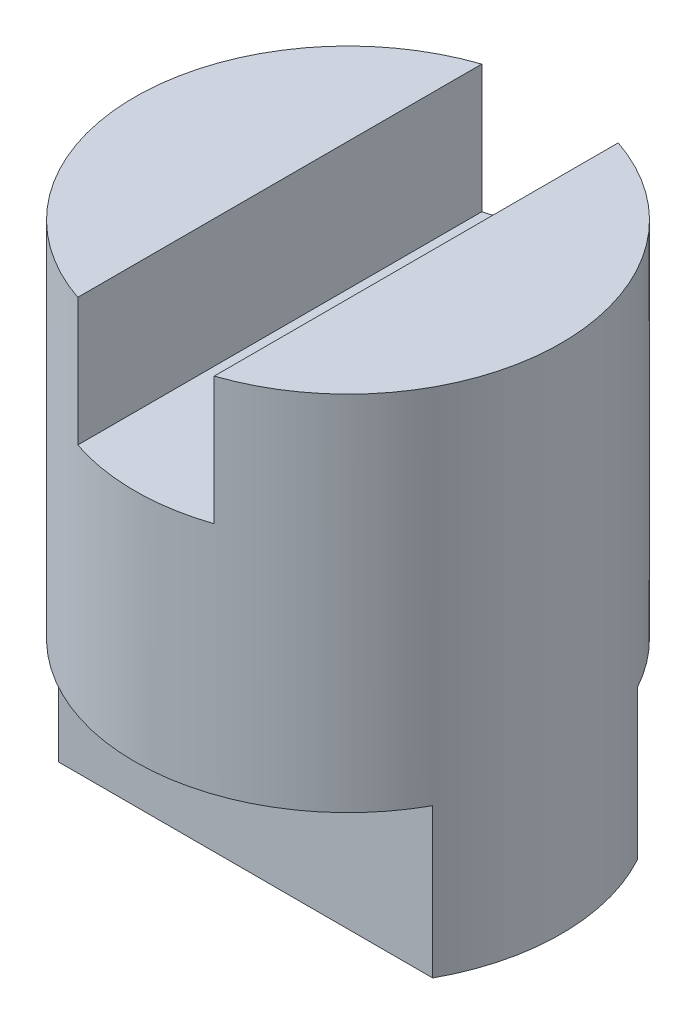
ISO-10303-21;
HEADER;
FILE_DESCRIPTION(('STEP AP214'),'2;1');
FILE_NAME('part.step','',(''),(''),'','','');
FILE_SCHEMA(('AUTOMOTIVE_DESIGN { 1 0 10303 214 1 1 1 1 }'));
ENDSEC;
DATA;
#1=APPLICATION_CONTEXT('core data for automotive mechanical design processes');
#2=APPLICATION_PROTOCOL_DEFINITION('international standard','automotive_design',2000,#1);
#3=PRODUCT_CONTEXT('',#1,'mechanical');
#4=PRODUCT('Part','Part','',(#3));
#5=PRODUCT_RELATED_PRODUCT_CATEGORY('part','',(#4));
#6=PRODUCT_DEFINITION_FORMATION('','',#4);
#7=PRODUCT_DEFINITION_CONTEXT('part definition',#1,'design');
#8=PRODUCT_DEFINITION('design','',#6,#7);
#9=PRODUCT_DEFINITION_SHAPE('','',#8);
#10=(LENGTH_UNIT() NAMED_UNIT(*) SI_UNIT(.MILLI.,.METRE.));
#11=(NAMED_UNIT(*) PLANE_ANGLE_UNIT() SI_UNIT($,.RADIAN.));
#12=(NAMED_UNIT(*) SI_UNIT($,.STERADIAN.) SOLID_ANGLE_UNIT());
#13=UNCERTAINTY_MEASURE_WITH_UNIT(LENGTH_MEASURE(1.E-05),#10,'distance_accuracy_value','');
#14=(GEOMETRIC_REPRESENTATION_CONTEXT(3) GLOBAL_UNCERTAINTY_ASSIGNED_CONTEXT((#13)) GLOBAL_UNIT_ASSIGNED_CONTEXT((#10,
#11,#12)) REPRESENTATION_CONTEXT('',''));
#15=CARTESIAN_POINT('',(0.,0.,0.));
#16=DIRECTION('',(0.,0.,1.));
#17=DIRECTION('',(1.,0.,0.));
#18=AXIS2_PLACEMENT_3D('',#15,#16,#17);
#19=CARTESIAN_POINT('',(0.,120.,0.));
#20=DIRECTION('',(0.,1.,0.));
#21=DIRECTION('',(0.,0.,1.));
#22=AXIS2_PLACEMENT_3D('',#19,#20,#21);
#23=PLANE('',#22);
#24=CARTESIAN_POINT('',(0.,120.,0.));
#25=DIRECTION('',(0.,1.,0.));
#26=DIRECTION('',(0.,0.,1.));
#27=AXIS2_PLACEMENT_3D('',#24,#25,#26);
#28=CIRCLE('',#27,50.);
#29=CARTESIAN_POINT('',(-16.,120.,-47.370877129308));
#30=VERTEX_POINT('',#29);
#31=CARTESIAN_POINT('',(-16.,120.,47.3708771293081));
#32=VERTEX_POINT('',#31);
#33=EDGE_CURVE('E117',#30,#32,#28,.T.);
#34=ORIENTED_EDGE('',*,*,#33,.T.);
#35=DIRECTION('',(0.,0.,-1.));
#36=VECTOR('',#35,1.);
#37=CARTESIAN_POINT('',(-16.,120.,0.));
#38=LINE('',#37,#36);
#39=EDGE_CURVE('E122',#32,#30,#38,.T.);
#40=ORIENTED_EDGE('',*,*,#39,.T.);
#41=EDGE_LOOP('',(#34,#40));
#42=FACE_BOUND('',#41,.T.);
#43=ADVANCED_FACE('F31',(#42),#23,.T.);
#44=CARTESIAN_POINT('',(0.,120.,0.));
#45=DIRECTION('',(0.,-1.,0.));
#46=DIRECTION('',(0.,0.,-1.));
#47=AXIS2_PLACEMENT_3D('',#44,#45,#46);
#48=CYLINDRICAL_SURFACE('',#47,50.);
#49=CARTESIAN_POINT('',(0.,90.,0.));
#50=DIRECTION('',(0.,-1.,0.));
#51=DIRECTION('',(0.,0.,-1.));
#52=AXIS2_PLACEMENT_3D('',#49,#50,#51);
#53=CIRCLE('',#52,50.);
#54=CARTESIAN_POINT('',(-16.,90.,-47.370877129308));
#55=VERTEX_POINT('',#54);
#56=CARTESIAN_POINT('',(16.,90.,-47.3708771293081));
#57=VERTEX_POINT('',#56);
#58=EDGE_CURVE('E118',#55,#57,#53,.T.);
#59=ORIENTED_EDGE('',*,*,#58,.T.);
#60=DIRECTION('',(0.,-1.,0.));
#61=VECTOR('',#60,1.);
#62=CARTESIAN_POINT('',(16.,120.,-47.370877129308));
#63=LINE('',#62,#61);
#64=CARTESIAN_POINT('',(16.,120.,-47.370877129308));
#65=VERTEX_POINT('',#64);
#66=EDGE_CURVE('E121',#57,#65,#63,.F.);
#67=ORIENTED_EDGE('',*,*,#66,.T.);
#68=CARTESIAN_POINT('',(16.,120.,47.3708771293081));
#69=VERTEX_POINT('',#68);
#70=EDGE_CURVE('E125',#69,#65,#28,.T.);
#71=ORIENTED_EDGE('',*,*,#70,.F.);
#72=DIRECTION('',(0.,-1.,0.));
#73=VECTOR('',#72,1.);
#74=CARTESIAN_POINT('',(16.,120.,47.370877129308));
#75=LINE('',#74,#73);
#76=CARTESIAN_POINT('',(16.,90.,47.3708771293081));
#77=VERTEX_POINT('',#76);
#78=EDGE_CURVE('E126',#69,#77,#75,.T.);
#79=ORIENTED_EDGE('',*,*,#78,.T.);
#80=CARTESIAN_POINT('',(-16.,90.,47.3708771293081));
#81=VERTEX_POINT('',#80);
#82=EDGE_CURVE('E123',#77,#81,#53,.T.);
#83=ORIENTED_EDGE('',*,*,#82,.T.);
#84=DIRECTION('',(0.,-1.,0.));
#85=VECTOR('',#84,1.);
#86=CARTESIAN_POINT('',(-16.,120.,47.370877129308));
#87=LINE('',#86,#85);
#88=EDGE_CURVE('E134',#81,#32,#87,.F.);
#89=ORIENTED_EDGE('',*,*,#88,.T.);
#90=ORIENTED_EDGE('',*,*,#33,.F.);
#91=DIRECTION('',(0.,-1.,0.));
#92=VECTOR('',#91,1.);
#93=CARTESIAN_POINT('',(-16.,120.,-47.370877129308));
#94=LINE('',#93,#92);
#95=EDGE_CURVE('E131',#30,#55,#94,.T.);
#96=ORIENTED_EDGE('',*,*,#95,.T.);
#97=EDGE_LOOP('',(#59,#67,#71,#79,#83,#89,#90,#96));
#98=FACE_BOUND('',#97,.T.);
#99=CARTESIAN_POINT('',(0.,35.,0.));
#100=DIRECTION('',(0.,1.,0.));
#101=DIRECTION('',(0.,0.,1.));
#102=AXIS2_PLACEMENT_3D('',#99,#100,#101);
#103=CIRCLE('',#102,50.);
#104=CARTESIAN_POINT('',(43.8634243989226,35.,-24.));
#105=VERTEX_POINT('',#104);
#106=CARTESIAN_POINT('',(-43.8634243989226,35.,-24.));
#107=VERTEX_POINT('',#106);
#108=EDGE_CURVE('E11',#105,#107,#103,.T.);
#109=ORIENTED_EDGE('',*,*,#108,.T.);
#110=DIRECTION('',(0.,-1.,0.));
#111=VECTOR('',#110,1.);
#112=CARTESIAN_POINT('',(-43.8634243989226,120.,-24.));
#113=LINE('',#112,#111);
#114=CARTESIAN_POINT('',(-43.8634243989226,0.,-24.));
#115=VERTEX_POINT('',#114);
#116=EDGE_CURVE('E96',#107,#115,#113,.T.);
#117=ORIENTED_EDGE('',*,*,#116,.T.);
#118=CARTESIAN_POINT('',(0.,0.,0.));
#119=DIRECTION('',(0.,1.,0.));
#120=DIRECTION('',(0.,0.,1.));
#121=AXIS2_PLACEMENT_3D('',#118,#119,#120);
#122=CIRCLE('',#121,50.);
#123=CARTESIAN_POINT('',(-43.8634243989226,0.,24.));
#124=VERTEX_POINT('',#123);
#125=EDGE_CURVE('E54',#115,#124,#122,.T.);
#126=ORIENTED_EDGE('',*,*,#125,.T.);
#127=DIRECTION('',(0.,-1.,0.));
#128=VECTOR('',#127,1.);
#129=CARTESIAN_POINT('',(-43.8634243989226,120.,24.));
#130=LINE('',#129,#128);
#131=CARTESIAN_POINT('',(-43.8634243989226,35.,24.));
#132=VERTEX_POINT('',#131);
#133=EDGE_CURVE('E113',#124,#132,#130,.F.);
#134=ORIENTED_EDGE('',*,*,#133,.T.);
#135=CARTESIAN_POINT('',(0.,35.,0.));
#136=DIRECTION('',(0.,1.,0.));
#137=DIRECTION('',(0.,0.,1.));
#138=AXIS2_PLACEMENT_3D('',#135,#136,#137);
#139=CIRCLE('',#138,50.);
#140=CARTESIAN_POINT('',(43.8634243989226,35.,24.));
#141=VERTEX_POINT('',#140);
#142=EDGE_CURVE('E152',#132,#141,#139,.T.);
#143=ORIENTED_EDGE('',*,*,#142,.T.);
#144=DIRECTION('',(0.,-1.,0.));
#145=VECTOR('',#144,1.);
#146=CARTESIAN_POINT('',(43.8634243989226,120.,24.));
#147=LINE('',#146,#145);
#148=CARTESIAN_POINT('',(43.8634243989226,0.,24.));
#149=VERTEX_POINT('',#148);
#150=EDGE_CURVE('E115',#141,#149,#147,.T.);
#151=ORIENTED_EDGE('',*,*,#150,.T.);
#152=CARTESIAN_POINT('',(43.8634243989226,0.,-24.));
#153=VERTEX_POINT('',#152);
#154=EDGE_CURVE('E108',#149,#153,#122,.T.);
#155=ORIENTED_EDGE('',*,*,#154,.T.);
#156=DIRECTION('',(0.,-1.,0.));
#157=VECTOR('',#156,1.);
#158=CARTESIAN_POINT('',(43.8634243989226,120.,-24.));
#159=LINE('',#158,#157);
#160=EDGE_CURVE('E46',#153,#105,#159,.F.);
#161=ORIENTED_EDGE('',*,*,#160,.T.);
#162=EDGE_LOOP('',(#109,#117,#126,#134,#143,#151,#155,#161));
#163=FACE_BOUND('',#162,.T.);
#164=ADVANCED_FACE('F33',(#98,#163),#48,.T.);
#165=DIRECTION('',(0.,0.,-1.));
#166=VECTOR('',#165,1.);
#167=CARTESIAN_POINT('',(16.,120.,0.));
#168=LINE('',#167,#166);
#169=EDGE_CURVE('E144',#69,#65,#168,.T.);
#170=ORIENTED_EDGE('',*,*,#169,.F.);
#171=ORIENTED_EDGE('',*,*,#70,.T.);
#172=EDGE_LOOP('',(#170,#171));
#173=FACE_BOUND('',#172,.T.);
#174=ADVANCED_FACE('F175',(#173),#23,.T.);
#175=CARTESIAN_POINT('',(0.,0.,0.));
#176=DIRECTION('',(0.,1.,0.));
#177=DIRECTION('',(0.,0.,1.));
#178=AXIS2_PLACEMENT_3D('',#175,#176,#177);
#179=PLANE('',#178);
#180=ORIENTED_EDGE('',*,*,#125,.F.);
#181=DIRECTION('',(1.,0.,0.));
#182=VECTOR('',#181,1.);
#183=CARTESIAN_POINT('',(0.,0.,-24.));
#184=LINE('',#183,#182);
#185=EDGE_CURVE('E39',#115,#153,#184,.T.);
#186=ORIENTED_EDGE('',*,*,#185,.T.);
#187=ORIENTED_EDGE('',*,*,#154,.F.);
#188=DIRECTION('',(-1.,0.,0.));
#189=VECTOR('',#188,1.);
#190=CARTESIAN_POINT('',(0.,0.,24.));
#191=LINE('',#190,#189);
#192=EDGE_CURVE('E140',#149,#124,#191,.T.);
#193=ORIENTED_EDGE('',*,*,#192,.T.);
#194=EDGE_LOOP('',(#180,#186,#187,#193));
#195=FACE_BOUND('',#194,.T.);
#196=ADVANCED_FACE('F155',(#195),#179,.F.);
#197=CARTESIAN_POINT('',(-16.,120.,-50.));
#198=DIRECTION('',(-1.,0.,0.));
#199=DIRECTION('',(0.,-1.,0.));
#200=AXIS2_PLACEMENT_3D('',#197,#198,#199);
#201=PLANE('',#200);
#202=ORIENTED_EDGE('',*,*,#39,.F.);
#203=ORIENTED_EDGE('',*,*,#88,.F.);
#204=DIRECTION('',(0.,0.,1.));
#205=VECTOR('',#204,1.);
#206=CARTESIAN_POINT('',(-16.,90.,-50.));
#207=LINE('',#206,#205);
#208=EDGE_CURVE('E137',#55,#81,#207,.T.);
#209=ORIENTED_EDGE('',*,*,#208,.F.);
#210=ORIENTED_EDGE('',*,*,#95,.F.);
#211=EDGE_LOOP('',(#202,#203,#209,#210));
#212=FACE_BOUND('',#211,.T.);
#213=ADVANCED_FACE('F187',(#212),#201,.F.);
#214=CARTESIAN_POINT('',(16.,120.,-50.));
#215=DIRECTION('',(1.,0.,0.));
#216=DIRECTION('',(0.,1.,0.));
#217=AXIS2_PLACEMENT_3D('',#214,#215,#216);
#218=PLANE('',#217);
#219=ORIENTED_EDGE('',*,*,#169,.T.);
#220=ORIENTED_EDGE('',*,*,#66,.F.);
#221=DIRECTION('',(0.,0.,1.));
#222=VECTOR('',#221,1.);
#223=CARTESIAN_POINT('',(16.,90.,-50.));
#224=LINE('',#223,#222);
#225=EDGE_CURVE('E141',#57,#77,#224,.T.);
#226=ORIENTED_EDGE('',*,*,#225,.T.);
#227=ORIENTED_EDGE('',*,*,#78,.F.);
#228=EDGE_LOOP('',(#219,#220,#226,#227));
#229=FACE_BOUND('',#228,.T.);
#230=ADVANCED_FACE('F169',(#229),#218,.F.);
#231=CARTESIAN_POINT('',(-16.,90.,-50.));
#232=DIRECTION('',(0.,-1.,0.));
#233=DIRECTION('',(0.,0.,-1.));
#234=AXIS2_PLACEMENT_3D('',#231,#232,#233);
#235=PLANE('',#234);
#236=ORIENTED_EDGE('',*,*,#225,.F.);
#237=ORIENTED_EDGE('',*,*,#58,.F.);
#238=ORIENTED_EDGE('',*,*,#208,.T.);
#239=ORIENTED_EDGE('',*,*,#82,.F.);
#240=EDGE_LOOP('',(#236,#237,#238,#239));
#241=FACE_BOUND('',#240,.T.);
#242=ADVANCED_FACE('F162',(#241),#235,.F.);
#243=CARTESIAN_POINT('',(-50.,35.,24.));
#244=DIRECTION('',(0.,1.,0.));
#245=DIRECTION('',(0.,0.,1.));
#246=AXIS2_PLACEMENT_3D('',#243,#244,#245);
#247=PLANE('',#246);
#248=DIRECTION('',(1.,0.,0.));
#249=VECTOR('',#248,1.);
#250=CARTESIAN_POINT('',(-50.,35.,24.));
#251=LINE('',#250,#249);
#252=EDGE_CURVE('E100',#132,#141,#251,.T.);
#253=ORIENTED_EDGE('',*,*,#252,.T.);
#254=ORIENTED_EDGE('',*,*,#142,.F.);
#255=EDGE_LOOP('',(#253,#254));
#256=FACE_BOUND('',#255,.T.);
#257=ADVANCED_FACE('F160',(#256),#247,.F.);
#258=CARTESIAN_POINT('',(-50.,0.,24.));
#259=DIRECTION('',(0.,0.,-1.));
#260=DIRECTION('',(0.,1.,0.));
#261=AXIS2_PLACEMENT_3D('',#258,#259,#260);
#262=PLANE('',#261);
#263=ORIENTED_EDGE('',*,*,#252,.F.);
#264=ORIENTED_EDGE('',*,*,#133,.F.);
#265=ORIENTED_EDGE('',*,*,#192,.F.);
#266=ORIENTED_EDGE('',*,*,#150,.F.);
#267=EDGE_LOOP('',(#263,#264,#265,#266));
#268=FACE_BOUND('',#267,.T.);
#269=ADVANCED_FACE('F158',(#268),#262,.F.);
#270=CARTESIAN_POINT('',(-50.,35.,-24.));
#271=DIRECTION('',(0.,1.,0.));
#272=DIRECTION('',(0.,0.,1.));
#273=AXIS2_PLACEMENT_3D('',#270,#271,#272);
#274=PLANE('',#273);
#275=DIRECTION('',(1.,0.,0.));
#276=VECTOR('',#275,1.);
#277=CARTESIAN_POINT('',(-50.,35.,-24.));
#278=LINE('',#277,#276);
#279=EDGE_CURVE('E99',#107,#105,#278,.T.);
#280=ORIENTED_EDGE('',*,*,#279,.F.);
#281=ORIENTED_EDGE('',*,*,#108,.F.);
#282=EDGE_LOOP('',(#280,#281));
#283=FACE_BOUND('',#282,.T.);
#284=ADVANCED_FACE('F103',(#283),#274,.F.);
#285=CARTESIAN_POINT('',(-50.,-21.9210731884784,-24.));
#286=DIRECTION('',(0.,0.,1.));
#287=DIRECTION('',(1.,0.,0.));
#288=AXIS2_PLACEMENT_3D('',#285,#286,#287);
#289=PLANE('',#288);
#290=ORIENTED_EDGE('',*,*,#279,.T.);
#291=ORIENTED_EDGE('',*,*,#160,.F.);
#292=ORIENTED_EDGE('',*,*,#185,.F.);
#293=ORIENTED_EDGE('',*,*,#116,.F.);
#294=EDGE_LOOP('',(#290,#291,#292,#293));
#295=FACE_BOUND('',#294,.T.);
#296=ADVANCED_FACE('F98',(#295),#289,.F.);
#297=CLOSED_SHELL('',(#43,#164,#174,#196,#213,#230,#242,#257,#269,#284,#296));
#298=MANIFOLD_SOLID_BREP('B2',#297);
#299=ADVANCED_BREP_SHAPE_REPRESENTATION('',(#18,#298),#14);
#300=SHAPE_DEFINITION_REPRESENTATION(#9,#299);
ENDSEC;
END-ISO-10303-21;
